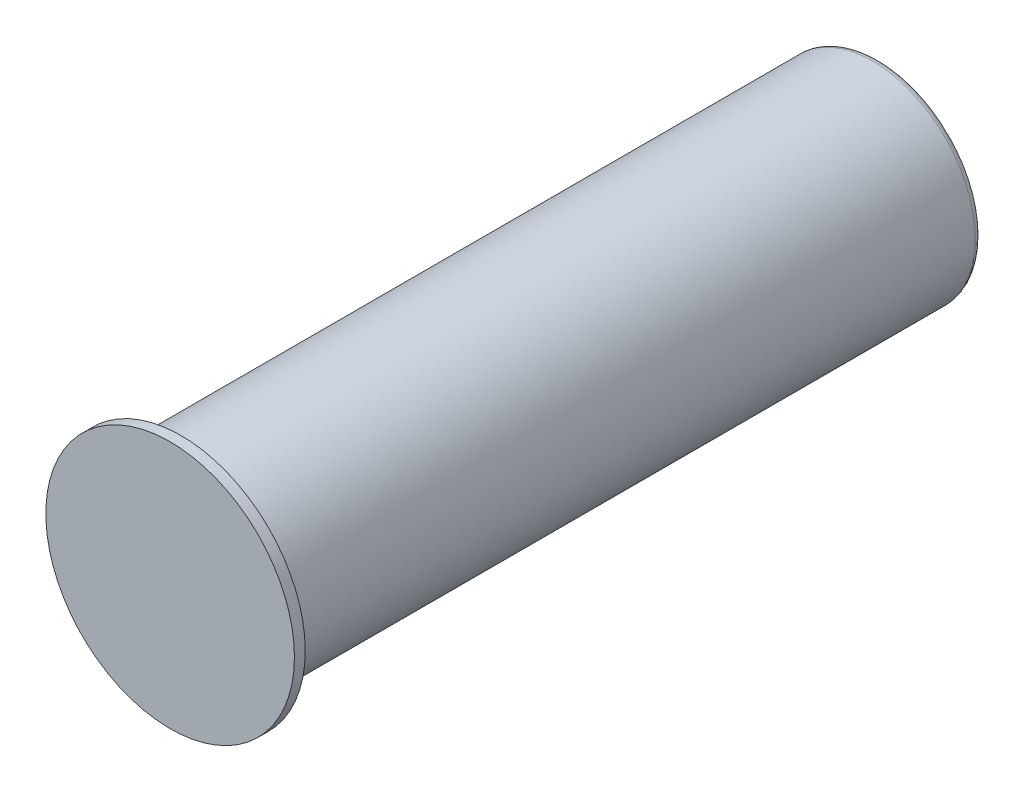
ISO-10303-21;
HEADER;
FILE_DESCRIPTION(('STEP AP214'),'2;1');
FILE_NAME('part.step','',(''),(''),'','','');
FILE_SCHEMA(('AUTOMOTIVE_DESIGN { 1 0 10303 214 1 1 1 1 }'));
ENDSEC;
DATA;
#1=APPLICATION_CONTEXT('core data for automotive mechanical design processes');
#2=APPLICATION_PROTOCOL_DEFINITION('international standard','automotive_design',2000,#1);
#3=PRODUCT_CONTEXT('',#1,'mechanical');
#4=PRODUCT('Part','Part','',(#3));
#5=PRODUCT_RELATED_PRODUCT_CATEGORY('part','',(#4));
#6=PRODUCT_DEFINITION_FORMATION('','',#4);
#7=PRODUCT_DEFINITION_CONTEXT('part definition',#1,'design');
#8=PRODUCT_DEFINITION('design','',#6,#7);
#9=PRODUCT_DEFINITION_SHAPE('','',#8);
#10=(LENGTH_UNIT() NAMED_UNIT(*) SI_UNIT(.MILLI.,.METRE.));
#11=(NAMED_UNIT(*) PLANE_ANGLE_UNIT() SI_UNIT($,.RADIAN.));
#12=(NAMED_UNIT(*) SI_UNIT($,.STERADIAN.) SOLID_ANGLE_UNIT());
#13=UNCERTAINTY_MEASURE_WITH_UNIT(LENGTH_MEASURE(1.E-05),#10,'distance_accuracy_value','');
#14=(GEOMETRIC_REPRESENTATION_CONTEXT(3) GLOBAL_UNCERTAINTY_ASSIGNED_CONTEXT((#13)) GLOBAL_UNIT_ASSIGNED_CONTEXT((#10,
#11,#12)) REPRESENTATION_CONTEXT('',''));
#15=CARTESIAN_POINT('',(0.,0.,0.));
#16=DIRECTION('',(0.,0.,1.));
#17=DIRECTION('',(1.,0.,0.));
#18=AXIS2_PLACEMENT_3D('',#15,#16,#17);
#19=CARTESIAN_POINT('',(0.,0.,0.));
#20=DIRECTION('',(0.,0.,-1.));
#21=DIRECTION('',(-1.,0.,0.));
#22=AXIS2_PLACEMENT_3D('',#19,#20,#21);
#23=PLANE('',#22);
#24=CARTESIAN_POINT('',(0.,0.,0.));
#25=DIRECTION('',(0.,0.,1.));
#26=DIRECTION('',(1.,0.,0.));
#27=AXIS2_PLACEMENT_3D('',#24,#25,#26);
#28=CIRCLE('',#27,57.5);
#29=CARTESIAN_POINT('',(57.5,0.,0.));
#30=VERTEX_POINT('',#29);
#31=EDGE_CURVE('E11',#30,#30,#28,.T.);
#32=ORIENTED_EDGE('',*,*,#31,.T.);
#33=EDGE_LOOP('',(#32));
#34=FACE_BOUND('',#33,.T.);
#35=ADVANCED_FACE('F32',(#34),#23,.F.);
#36=CARTESIAN_POINT('',(0.,0.,0.));
#37=DIRECTION('',(0.,0.,1.));
#38=DIRECTION('',(1.,0.,0.));
#39=AXIS2_PLACEMENT_3D('',#36,#37,#38);
#40=CYLINDRICAL_SURFACE('',#39,57.5);
#41=ORIENTED_EDGE('',*,*,#31,.F.);
#42=EDGE_LOOP('',(#41));
#43=FACE_BOUND('',#42,.T.);
#44=CARTESIAN_POINT('',(0.,0.,-5.));
#45=DIRECTION('',(0.,0.,1.));
#46=DIRECTION('',(1.,0.,0.));
#47=AXIS2_PLACEMENT_3D('',#44,#45,#46);
#48=CIRCLE('',#47,57.5);
#49=CARTESIAN_POINT('',(57.5,0.,-5.));
#50=VERTEX_POINT('',#49);
#51=EDGE_CURVE('E38',#50,#50,#48,.T.);
#52=ORIENTED_EDGE('',*,*,#51,.T.);
#53=EDGE_LOOP('',(#52));
#54=FACE_BOUND('',#53,.T.);
#55=ADVANCED_FACE('F54',(#43,#54),#40,.T.);
#56=CARTESIAN_POINT('',(0.,57.5,-5.));
#57=DIRECTION('',(0.,0.,1.));
#58=DIRECTION('',(1.,0.,0.));
#59=AXIS2_PLACEMENT_3D('',#56,#57,#58);
#60=PLANE('',#59);
#61=ORIENTED_EDGE('',*,*,#51,.F.);
#62=EDGE_LOOP('',(#61));
#63=FACE_BOUND('',#62,.T.);
#64=CARTESIAN_POINT('',(0.,0.,-5.));
#65=DIRECTION('',(0.,0.,1.));
#66=DIRECTION('',(1.,0.,0.));
#67=AXIS2_PLACEMENT_3D('',#64,#65,#66);
#68=CIRCLE('',#67,47.5);
#69=CARTESIAN_POINT('',(47.5,0.,-5.));
#70=VERTEX_POINT('',#69);
#71=EDGE_CURVE('E66',#70,#70,#68,.T.);
#72=ORIENTED_EDGE('',*,*,#71,.T.);
#73=EDGE_LOOP('',(#72));
#74=FACE_BOUND('',#73,.T.);
#75=ADVANCED_FACE('F59',(#63,#74),#60,.F.);
#76=CARTESIAN_POINT('',(0.,0.,0.));
#77=DIRECTION('',(0.,0.,1.));
#78=DIRECTION('',(1.,0.,0.));
#79=AXIS2_PLACEMENT_3D('',#76,#77,#78);
#80=CYLINDRICAL_SURFACE('',#79,47.5);
#81=ORIENTED_EDGE('',*,*,#71,.F.);
#82=EDGE_LOOP('',(#81));
#83=FACE_BOUND('',#82,.T.);
#84=CARTESIAN_POINT('',(0.,0.,-325.));
#85=DIRECTION('',(0.,0.,1.));
#86=DIRECTION('',(1.,0.,0.));
#87=AXIS2_PLACEMENT_3D('',#84,#85,#86);
#88=CIRCLE('',#87,47.5);
#89=CARTESIAN_POINT('',(47.5,0.,-325.));
#90=VERTEX_POINT('',#89);
#91=EDGE_CURVE('E68',#90,#90,#88,.T.);
#92=ORIENTED_EDGE('',*,*,#91,.T.);
#93=EDGE_LOOP('',(#92));
#94=FACE_BOUND('',#93,.T.);
#95=ADVANCED_FACE('F101',(#83,#94),#80,.T.);
#96=CARTESIAN_POINT('',(0.,0.,-325.));
#97=DIRECTION('',(0.,0.,1.));
#98=DIRECTION('',(1.,0.,0.));
#99=AXIS2_PLACEMENT_3D('',#96,#97,#98);
#100=TOROIDAL_SURFACE('',#99,44.5,3.);
#101=ORIENTED_EDGE('',*,*,#91,.F.);
#102=EDGE_LOOP('',(#101));
#103=FACE_BOUND('',#102,.T.);
#104=CARTESIAN_POINT('',(0.,0.,-328.));
#105=DIRECTION('',(0.,0.,1.));
#106=DIRECTION('',(1.,0.,0.));
#107=AXIS2_PLACEMENT_3D('',#104,#105,#106);
#108=CIRCLE('',#107,44.5);
#109=CARTESIAN_POINT('',(44.5,0.,-328.));
#110=VERTEX_POINT('',#109);
#111=EDGE_CURVE('E73',#110,#110,#108,.T.);
#112=ORIENTED_EDGE('',*,*,#111,.T.);
#113=EDGE_LOOP('',(#112));
#114=FACE_BOUND('',#113,.T.);
#115=ADVANCED_FACE('F94',(#103,#114),#100,.T.);
#116=CARTESIAN_POINT('',(0.,44.5,-328.));
#117=DIRECTION('',(0.,0.,1.));
#118=DIRECTION('',(1.,0.,0.));
#119=AXIS2_PLACEMENT_3D('',#116,#117,#118);
#120=PLANE('',#119);
#121=ORIENTED_EDGE('',*,*,#111,.F.);
#122=EDGE_LOOP('',(#121));
#123=FACE_BOUND('',#122,.T.);
#124=CARTESIAN_POINT('',(0.,0.,-328.));
#125=DIRECTION('',(0.,0.,1.));
#126=DIRECTION('',(1.,0.,0.));
#127=AXIS2_PLACEMENT_3D('',#124,#125,#126);
#128=CIRCLE('',#127,9.50000000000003);
#129=CARTESIAN_POINT('',(9.50000000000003,0.,-328.));
#130=VERTEX_POINT('',#129);
#131=EDGE_CURVE('E76',#130,#130,#128,.T.);
#132=ORIENTED_EDGE('',*,*,#131,.T.);
#133=EDGE_LOOP('',(#132));
#134=FACE_BOUND('',#133,.T.);
#135=ADVANCED_FACE('F88',(#123,#134),#120,.F.);
#136=CARTESIAN_POINT('',(0.,0.,-326.5));
#137=DIRECTION('',(0.,0.,-1.));
#138=DIRECTION('',(-1.,0.,0.));
#139=AXIS2_PLACEMENT_3D('',#136,#137,#138);
#140=CONICAL_SURFACE('',#139,8.00000000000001,0.785398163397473);
#141=ORIENTED_EDGE('',*,*,#131,.F.);
#142=EDGE_LOOP('',(#141));
#143=FACE_BOUND('',#142,.T.);
#144=CARTESIAN_POINT('',(0.,0.,-326.5));
#145=DIRECTION('',(0.,0.,1.));
#146=DIRECTION('',(1.,0.,0.));
#147=AXIS2_PLACEMENT_3D('',#144,#145,#146);
#148=CIRCLE('',#147,8.00000000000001);
#149=CARTESIAN_POINT('',(8.00000000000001,0.,-326.5));
#150=VERTEX_POINT('',#149);
#151=EDGE_CURVE('E79',#150,#150,#148,.T.);
#152=ORIENTED_EDGE('',*,*,#151,.T.);
#153=EDGE_LOOP('',(#152));
#154=FACE_BOUND('',#153,.T.);
#155=ADVANCED_FACE('F49',(#143,#154),#140,.F.);
#156=CARTESIAN_POINT('',(0.,0.,0.));
#157=DIRECTION('',(0.,0.,1.));
#158=DIRECTION('',(1.,0.,0.));
#159=AXIS2_PLACEMENT_3D('',#156,#157,#158);
#160=CYLINDRICAL_SURFACE('',#159,8.00000000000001);
#161=ORIENTED_EDGE('',*,*,#151,.F.);
#162=EDGE_LOOP('',(#161));
#163=FACE_BOUND('',#162,.T.);
#164=CARTESIAN_POINT('',(0.,0.,-312.));
#165=DIRECTION('',(0.,0.,1.));
#166=DIRECTION('',(1.,0.,0.));
#167=AXIS2_PLACEMENT_3D('',#164,#165,#166);
#168=CIRCLE('',#167,8.00000000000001);
#169=CARTESIAN_POINT('',(8.00000000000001,0.,-312.));
#170=VERTEX_POINT('',#169);
#171=EDGE_CURVE('E82',#170,#170,#168,.T.);
#172=ORIENTED_EDGE('',*,*,#171,.T.);
#173=EDGE_LOOP('',(#172));
#174=FACE_BOUND('',#173,.T.);
#175=ADVANCED_FACE('F43',(#163,#174),#160,.F.);
#176=CARTESIAN_POINT('',(0.,0.,-307.381197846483));
#177=DIRECTION('',(0.,0.,-1.));
#178=DIRECTION('',(-1.,0.,0.));
#179=AXIS2_PLACEMENT_3D('',#176,#177,#178);
#180=CONICAL_SURFACE('',#179,0.,1.04719755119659);
#181=ORIENTED_EDGE('',*,*,#171,.F.);
#182=EDGE_LOOP('',(#181));
#183=FACE_BOUND('',#182,.T.);
#184=CARTESIAN_POINT('',(0.,0.,-307.381197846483));
#185=VERTEX_POINT('',#184);
#186=VERTEX_LOOP('',#185);
#187=FACE_BOUND('',#186,.T.);
#188=ADVANCED_FACE('F41',(#183,#187),#180,.F.);
#189=CLOSED_SHELL('',(#35,#55,#75,#95,#115,#135,#155,#175,#188));
#190=MANIFOLD_SOLID_BREP('B2',#189);
#191=ADVANCED_BREP_SHAPE_REPRESENTATION('',(#18,#190),#14);
#192=SHAPE_DEFINITION_REPRESENTATION(#9,#191);
ENDSEC;
END-ISO-10303-21;
